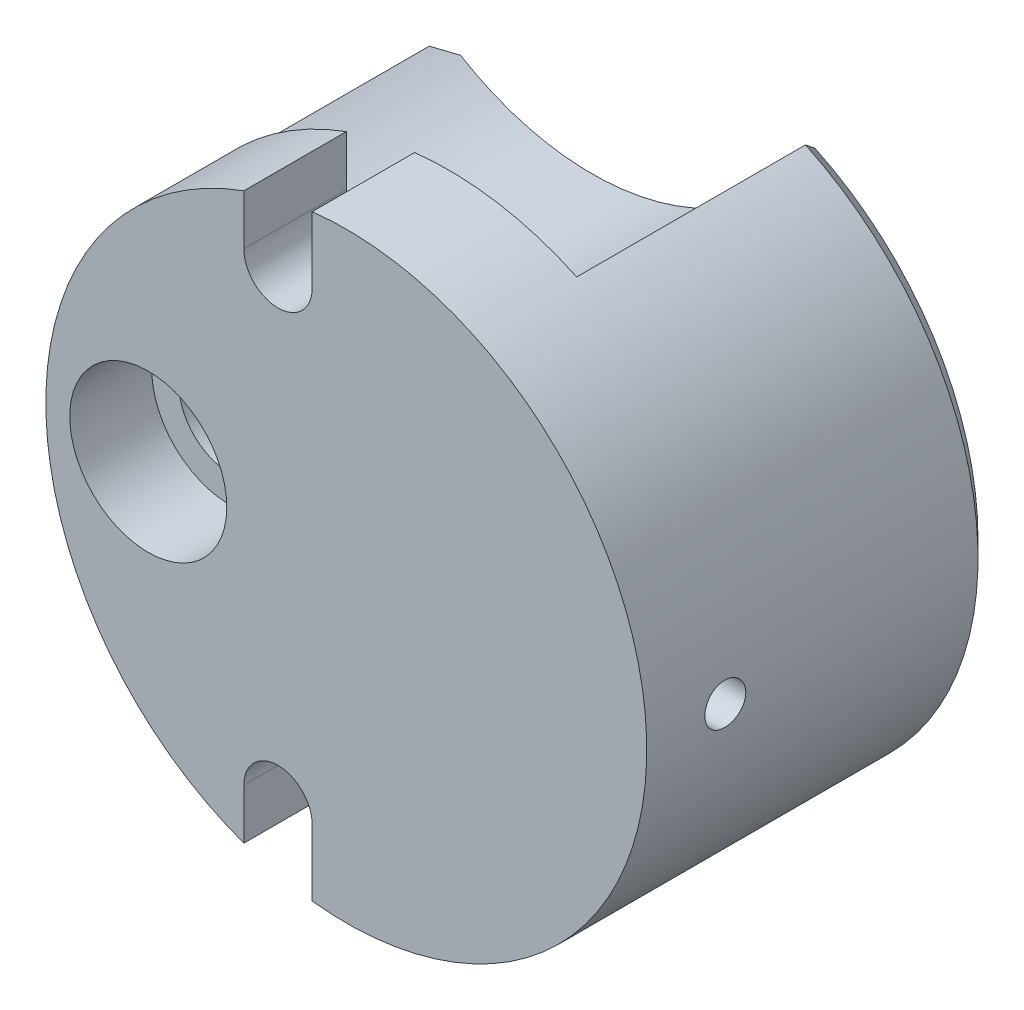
ISO-10303-21;
HEADER;
FILE_DESCRIPTION(('STEP AP214'),'2;1');
FILE_NAME('part.step','',(''),(''),'','','');
FILE_SCHEMA(('AUTOMOTIVE_DESIGN { 1 0 10303 214 1 1 1 1 }'));
ENDSEC;
DATA;
#1=APPLICATION_CONTEXT('core data for automotive mechanical design processes');
#2=APPLICATION_PROTOCOL_DEFINITION('international standard','automotive_design',2000,#1);
#3=PRODUCT_CONTEXT('',#1,'mechanical');
#4=PRODUCT('Part','Part','',(#3));
#5=PRODUCT_RELATED_PRODUCT_CATEGORY('part','',(#4));
#6=PRODUCT_DEFINITION_FORMATION('','',#4);
#7=PRODUCT_DEFINITION_CONTEXT('part definition',#1,'design');
#8=PRODUCT_DEFINITION('design','',#6,#7);
#9=PRODUCT_DEFINITION_SHAPE('','',#8);
#10=(LENGTH_UNIT() NAMED_UNIT(*) SI_UNIT(.MILLI.,.METRE.));
#11=(NAMED_UNIT(*) PLANE_ANGLE_UNIT() SI_UNIT($,.RADIAN.));
#12=(NAMED_UNIT(*) SI_UNIT($,.STERADIAN.) SOLID_ANGLE_UNIT());
#13=UNCERTAINTY_MEASURE_WITH_UNIT(LENGTH_MEASURE(1.E-05),#10,'distance_accuracy_value','');
#14=(GEOMETRIC_REPRESENTATION_CONTEXT(3) GLOBAL_UNCERTAINTY_ASSIGNED_CONTEXT((#13)) GLOBAL_UNIT_ASSIGNED_CONTEXT((#10,
#11,#12)) REPRESENTATION_CONTEXT('',''));
#15=CARTESIAN_POINT('',(0.,0.,0.));
#16=DIRECTION('',(0.,0.,1.));
#17=DIRECTION('',(1.,0.,0.));
#18=AXIS2_PLACEMENT_3D('',#15,#16,#17);
#19=CARTESIAN_POINT('',(0.,0.,-51.));
#20=DIRECTION('',(0.,0.,1.));
#21=DIRECTION('',(1.,0.,0.));
#22=AXIS2_PLACEMENT_3D('',#19,#20,#21);
#23=CYLINDRICAL_SURFACE('',#22,44.);
#24=DIRECTION('',(0.,0.,-1.));
#25=VECTOR('',#24,1.);
#26=CARTESIAN_POINT('',(-15.,-41.3642357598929,0.00100000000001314));
#27=LINE('',#26,#25);
#28=CARTESIAN_POINT('',(-15.,-41.3642357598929,0.));
#29=VERTEX_POINT('',#28);
#30=CARTESIAN_POINT('',(-15.,-41.3642357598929,-15.));
#31=VERTEX_POINT('',#30);
#32=EDGE_CURVE('E144',#29,#31,#27,.T.);
#33=ORIENTED_EDGE('',*,*,#32,.F.);
#34=CARTESIAN_POINT('',(0.,0.,0.));
#35=DIRECTION('',(0.,0.,1.));
#36=DIRECTION('',(1.,0.,0.));
#37=AXIS2_PLACEMENT_3D('',#34,#35,#36);
#38=CIRCLE('',#37,44.);
#39=CARTESIAN_POINT('',(-15.,41.3642357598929,0.));
#40=VERTEX_POINT('',#39);
#41=EDGE_CURVE('E156',#40,#29,#38,.T.);
#42=ORIENTED_EDGE('',*,*,#41,.F.);
#43=DIRECTION('',(0.,0.,-1.));
#44=VECTOR('',#43,1.);
#45=CARTESIAN_POINT('',(-15.,41.3642357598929,0.00100000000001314));
#46=LINE('',#45,#44);
#47=CARTESIAN_POINT('',(-15.,41.3642357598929,-15.));
#48=VERTEX_POINT('',#47);
#49=EDGE_CURVE('E281',#40,#48,#46,.T.);
#50=ORIENTED_EDGE('',*,*,#49,.T.);
#51=CARTESIAN_POINT('',(0.,0.,-15.));
#52=DIRECTION('',(0.,0.,1.));
#53=DIRECTION('',(1.,0.,0.));
#54=AXIS2_PLACEMENT_3D('',#51,#52,#53);
#55=CIRCLE('',#54,44.);
#56=CARTESIAN_POINT('',(-36.3552998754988,24.7849182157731,-15.));
#57=VERTEX_POINT('',#56);
#58=EDGE_CURVE('E261',#48,#57,#55,.T.);
#59=ORIENTED_EDGE('',*,*,#58,.T.);
#60=DIRECTION('',(0.,0.,-1.));
#61=VECTOR('',#60,1.);
#62=CARTESIAN_POINT('',(-36.3552998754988,24.7849182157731,-15.));
#63=LINE('',#62,#61);
#64=CARTESIAN_POINT('',(-36.3552998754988,24.7849182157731,-48.5));
#65=VERTEX_POINT('',#64);
#66=EDGE_CURVE('E248',#57,#65,#63,.T.);
#67=ORIENTED_EDGE('',*,*,#66,.T.);
#68=CARTESIAN_POINT('',(0.,0.,-48.5));
#69=DIRECTION('',(0.,0.,1.));
#70=DIRECTION('',(1.,0.,0.));
#71=AXIS2_PLACEMENT_3D('',#68,#69,#70);
#72=CIRCLE('',#71,44.);
#73=CARTESIAN_POINT('',(-36.3552998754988,-24.7849182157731,-48.5));
#74=VERTEX_POINT('',#73);
#75=EDGE_CURVE('E170',#65,#74,#72,.T.);
#76=ORIENTED_EDGE('',*,*,#75,.T.);
#77=DIRECTION('',(0.,0.,-1.));
#78=VECTOR('',#77,1.);
#79=CARTESIAN_POINT('',(-36.3552998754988,-24.7849182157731,-15.));
#80=LINE('',#79,#78);
#81=CARTESIAN_POINT('',(-36.3552998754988,-24.7849182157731,-15.));
#82=VERTEX_POINT('',#81);
#83=EDGE_CURVE('E268',#82,#74,#80,.T.);
#84=ORIENTED_EDGE('',*,*,#83,.F.);
#85=CARTESIAN_POINT('',(0.,0.,-15.));
#86=DIRECTION('',(0.,0.,1.));
#87=DIRECTION('',(1.,0.,0.));
#88=AXIS2_PLACEMENT_3D('',#85,#86,#87);
#89=CIRCLE('',#88,44.);
#90=EDGE_CURVE('E159',#82,#31,#89,.T.);
#91=ORIENTED_EDGE('',*,*,#90,.T.);
#92=EDGE_LOOP('',(#33,#42,#50,#59,#67,#76,#84,#91));
#93=FACE_BOUND('',#92,.T.);
#94=ADVANCED_FACE('F32',(#93),#23,.T.);
#95=DIRECTION('',(0.,0.,-1.));
#96=VECTOR('',#95,1.);
#97=CARTESIAN_POINT('',(-5.00000000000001,-43.7149859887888,0.00100000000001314));
#98=LINE('',#97,#96);
#99=CARTESIAN_POINT('',(-5.00000000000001,-43.7149859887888,0.));
#100=VERTEX_POINT('',#99);
#101=CARTESIAN_POINT('',(-5.00000000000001,-43.7149859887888,-15.));
#102=VERTEX_POINT('',#101);
#103=EDGE_CURVE('E160',#100,#102,#98,.T.);
#104=ORIENTED_EDGE('',*,*,#103,.T.);
#105=CARTESIAN_POINT('',(18.7383767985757,-39.8104663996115,-15.));
#106=VERTEX_POINT('',#105);
#107=EDGE_CURVE('E273',#102,#106,#89,.T.);
#108=ORIENTED_EDGE('',*,*,#107,.T.);
#109=DIRECTION('',(0.,0.,-1.));
#110=VECTOR('',#109,1.);
#111=CARTESIAN_POINT('',(18.7383767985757,-39.8104663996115,-15.));
#112=LINE('',#111,#110);
#113=CARTESIAN_POINT('',(18.7383767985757,-39.8104663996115,-48.5));
#114=VERTEX_POINT('',#113);
#115=EDGE_CURVE('E265',#106,#114,#112,.T.);
#116=ORIENTED_EDGE('',*,*,#115,.T.);
#117=CARTESIAN_POINT('',(18.7383767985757,39.8104663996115,-48.5));
#118=VERTEX_POINT('',#117);
#119=EDGE_CURVE('E167',#114,#118,#72,.T.);
#120=ORIENTED_EDGE('',*,*,#119,.T.);
#121=DIRECTION('',(0.,0.,-1.));
#122=VECTOR('',#121,1.);
#123=CARTESIAN_POINT('',(18.7383767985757,39.8104663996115,-15.));
#124=LINE('',#123,#122);
#125=CARTESIAN_POINT('',(18.7383767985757,39.8104663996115,-15.));
#126=VERTEX_POINT('',#125);
#127=EDGE_CURVE('E250',#126,#118,#124,.T.);
#128=ORIENTED_EDGE('',*,*,#127,.F.);
#129=CARTESIAN_POINT('',(-5.00000000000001,43.7149859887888,-15.));
#130=VERTEX_POINT('',#129);
#131=EDGE_CURVE('E258',#126,#130,#55,.T.);
#132=ORIENTED_EDGE('',*,*,#131,.T.);
#133=DIRECTION('',(0.,0.,-1.));
#134=VECTOR('',#133,1.);
#135=CARTESIAN_POINT('',(-5.00000000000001,43.7149859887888,0.00100000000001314));
#136=LINE('',#135,#134);
#137=CARTESIAN_POINT('',(-5.00000000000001,43.7149859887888,0.));
#138=VERTEX_POINT('',#137);
#139=EDGE_CURVE('E284',#138,#130,#136,.T.);
#140=ORIENTED_EDGE('',*,*,#139,.F.);
#141=EDGE_CURVE('E168',#100,#138,#38,.T.);
#142=ORIENTED_EDGE('',*,*,#141,.F.);
#143=EDGE_LOOP('',(#104,#108,#116,#120,#128,#132,#140,#142));
#144=FACE_BOUND('',#143,.T.);
#145=CARTESIAN_POINT('',(44.,0.,-14.5));
#146=CARTESIAN_POINT('',(43.9999986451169,-0.168301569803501,-14.4999926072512));
#147=CARTESIAN_POINT('',(43.9990240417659,-0.336720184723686,-14.4857896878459));
#148=CARTESIAN_POINT('',(43.9952298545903,-0.668904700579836,-14.4293365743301));
#149=CARTESIAN_POINT('',(43.9924081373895,-0.832664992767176,-14.3870539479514));
#150=CARTESIAN_POINT('',(43.9852388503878,-1.15067322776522,-14.2756635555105));
#151=CARTESIAN_POINT('',(43.9808920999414,-1.30492622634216,-14.2065701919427));
#152=CARTESIAN_POINT('',(43.971161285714,-1.59960561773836,-14.0435435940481));
#153=CARTESIAN_POINT('',(43.9657774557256,-1.74003511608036,-13.9496159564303));
#154=CARTESIAN_POINT('',(43.9545668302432,-2.00336718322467,-13.7394073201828));
#155=CARTESIAN_POINT('',(43.9487393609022,-2.12624224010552,-13.6230918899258));
#156=CARTESIAN_POINT('',(43.9373039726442,-2.35074192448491,-13.3714810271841));
#157=CARTESIAN_POINT('',(43.9316960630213,-2.45236565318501,-13.236184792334));
#158=CARTESIAN_POINT('',(43.9213269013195,-2.63156551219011,-12.9502935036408));
#159=CARTESIAN_POINT('',(43.9165664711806,-2.7091183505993,-12.799683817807));
#160=CARTESIAN_POINT('',(43.9084379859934,-2.83782604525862,-12.4875432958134));
#161=CARTESIAN_POINT('',(43.9050699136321,-2.88898122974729,-12.3260125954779));
#162=CARTESIAN_POINT('',(43.9001124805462,-2.96336399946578,-11.9968839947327));
#163=CARTESIAN_POINT('',(43.8985203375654,-2.98663527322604,-11.8292960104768));
#164=CARTESIAN_POINT('',(43.8972859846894,-3.00472452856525,-11.4925855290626));
#165=CARTESIAN_POINT('',(43.8976437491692,-2.99954288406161,-11.3234630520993));
#166=CARTESIAN_POINT('',(43.9002662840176,-2.96090960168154,-10.9887824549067));
#167=CARTESIAN_POINT('',(43.902527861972,-2.92750528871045,-10.823218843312));
#168=CARTESIAN_POINT('',(43.9086981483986,-2.83344832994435,-10.5000541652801));
#169=CARTESIAN_POINT('',(43.912606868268,-2.77279549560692,-10.3424531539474));
#170=CARTESIAN_POINT('',(43.921634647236,-2.62590965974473,-10.0395356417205));
#171=CARTESIAN_POINT('',(43.9267547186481,-2.53965524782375,-9.89422955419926));
#172=CARTESIAN_POINT('',(43.9376272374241,-2.34403019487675,-9.62014044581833));
#173=CARTESIAN_POINT('',(43.9433796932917,-2.23465924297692,-9.49135764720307));
#174=CARTESIAN_POINT('',(43.9548829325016,-1.99563948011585,-9.25369548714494));
#175=CARTESIAN_POINT('',(43.9606336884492,-1.86594972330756,-9.14485729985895));
#176=CARTESIAN_POINT('',(43.9714742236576,-1.59011713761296,-8.95049165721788));
#177=CARTESIAN_POINT('',(43.9765640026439,-1.44397430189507,-8.86496421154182));
#178=CARTESIAN_POINT('',(43.9855095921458,-1.13935860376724,-8.71965112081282));
#179=CARTESIAN_POINT('',(43.9893653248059,-0.980884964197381,-8.65986709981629));
#180=CARTESIAN_POINT('',(43.995407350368,-0.656117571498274,-8.56776573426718));
#181=CARTESIAN_POINT('',(43.9975936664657,-0.489823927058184,-8.53544800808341));
#182=CARTESIAN_POINT('',(44.0000475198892,-0.154494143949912,-8.49924778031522));
#183=CARTESIAN_POINT('',(44.0003188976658,0.0145358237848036,-8.49530836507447));
#184=CARTESIAN_POINT('',(43.9989225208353,0.350854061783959,-8.51582778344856));
#185=CARTESIAN_POINT('',(43.9972547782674,0.518142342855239,-8.54028644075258));
#186=CARTESIAN_POINT('',(43.99217033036,0.846067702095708,-8.61686057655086));
#187=CARTESIAN_POINT('',(43.9887552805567,1.00671092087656,-8.66894987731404));
#188=CARTESIAN_POINT('',(43.9805602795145,1.31697578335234,-8.79928005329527));
#189=CARTESIAN_POINT('',(43.9757803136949,1.46659730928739,-8.87752120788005));
#190=CARTESIAN_POINT('',(43.9653826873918,1.75083181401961,-9.05807854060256));
#191=CARTESIAN_POINT('',(43.9597637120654,1.8854206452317,-9.16043265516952));
#192=CARTESIAN_POINT('',(43.9483245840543,2.13552602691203,-9.3862553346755));
#193=CARTESIAN_POINT('',(43.9425044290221,2.25104235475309,-9.50972414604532));
#194=CARTESIAN_POINT('',(43.9313077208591,2.45991703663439,-9.77451729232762));
#195=CARTESIAN_POINT('',(43.9259319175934,2.55323841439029,-9.91587083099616));
#196=CARTESIAN_POINT('',(43.9162421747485,2.71482107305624,-10.2122745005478));
#197=CARTESIAN_POINT('',(43.9119282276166,2.78308253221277,-10.3673245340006));
#198=CARTESIAN_POINT('',(43.9048541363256,2.89254388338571,-10.6865858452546));
#199=CARTESIAN_POINT('',(43.9020926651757,2.9337668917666,-10.8507891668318));
#200=CARTESIAN_POINT('',(43.8984312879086,2.98805661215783,-11.1838060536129));
#201=CARTESIAN_POINT('',(43.8975313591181,3.00112366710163,-11.3526195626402));
#202=CARTESIAN_POINT('',(43.897695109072,2.99872711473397,-11.6896972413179));
#203=CARTESIAN_POINT('',(43.8987547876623,2.98332162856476,-11.8579618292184));
#204=CARTESIAN_POINT('',(43.9027098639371,2.92453797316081,-12.1895088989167));
#205=CARTESIAN_POINT('',(43.9056052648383,2.88115975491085,-12.3527913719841));
#206=CARTESIAN_POINT('',(43.9129045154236,2.76767552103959,-12.6697466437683));
#207=CARTESIAN_POINT('',(43.9173083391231,2.69756996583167,-12.8234196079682));
#208=CARTESIAN_POINT('',(43.9271281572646,2.53262856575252,-13.1168224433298));
#209=CARTESIAN_POINT('',(43.9325441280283,2.43779329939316,-13.2565526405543));
#210=CARTESIAN_POINT('',(43.9437909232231,2.22586812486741,-13.5183993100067));
#211=CARTESIAN_POINT('',(43.9496225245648,2.10873581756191,-13.6404814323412));
#212=CARTESIAN_POINT('',(43.9610366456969,1.85560577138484,-13.8632942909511));
#213=CARTESIAN_POINT('',(43.9666191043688,1.71960343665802,-13.964019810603));
#214=CARTESIAN_POINT('',(43.9769127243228,1.43241329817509,-14.1413489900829));
#215=CARTESIAN_POINT('',(43.9816226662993,1.2812046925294,-14.2179189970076));
#216=CARTESIAN_POINT('',(43.9896248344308,0.968153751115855,-14.3444893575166));
#217=CARTESIAN_POINT('',(43.992918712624,0.806324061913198,-14.3945206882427));
#218=CARTESIAN_POINT('',(43.9968587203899,0.536260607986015,-14.4536536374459));
#219=CARTESIAN_POINT('',(43.9980314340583,0.429770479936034,-14.4710108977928));
#220=CARTESIAN_POINT('',(43.9996025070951,0.215536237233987,-14.4941864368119));
#221=CARTESIAN_POINT('',(44.0000008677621,0.107792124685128,-14.5000047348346));
#222=CARTESIAN_POINT('',(44.,0.,-14.5));
#223=B_SPLINE_CURVE_WITH_KNOTS('',3,(#145,#146,#147,#148,#149,#150,#151,#152,#153,#154,#155,
#156,#157,#158,#159,#160,#161,#162,#163,#164,#165,#166,#167,#168,#169,#170,#171,#172,#173,#174,
#175,#176,#177,#178,#179,#180,#181,#182,#183,#184,#185,#186,#187,#188,#189,#190,#191,#192,#193,
#194,#195,#196,#197,#198,#199,#200,#201,#202,#203,#204,#205,#206,#207,#208,#209,#210,#211,#212,
#213,#214,#215,#216,#217,#218,#219,#220,#221,#222),.UNSPECIFIED.,.T.,.F.,(4,2,2,2,2,2,2,2,2,2,2,
2,2,2,2,2,2,2,2,2,2,2,2,2,2,2,2,2,2,2,2,2,2,2,2,2,2,2,4),(0.,0.504511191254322,1.00960611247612,
1.51443007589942,2.01914036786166,2.52463317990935,3.03014736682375,3.53614919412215,
4.04214472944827,4.5473464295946,5.05254149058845,5.55689109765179,6.06124419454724,
6.56602027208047,7.07080313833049,7.57661663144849,8.08243033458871,8.58827594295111,
9.0941145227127,9.59893834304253,10.1037590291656,10.6081022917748,11.1124509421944,
11.6175984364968,12.1227518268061,12.6287409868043,13.1347265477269,13.640278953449,
14.1458252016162,14.6503406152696,15.1548569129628,15.6593645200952,16.1638603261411,
16.6693252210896,17.1749134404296,17.6812029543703,18.186900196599,18.5100250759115,
18.8331494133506),.UNSPECIFIED.);
#224=CARTESIAN_POINT('',(44.,0.,-14.5));
#225=VERTEX_POINT('',#224);
#226=EDGE_CURVE('E216',#225,#225,#223,.T.);
#227=ORIENTED_EDGE('',*,*,#226,.T.);
#228=EDGE_LOOP('',(#227));
#229=FACE_BOUND('',#228,.T.);
#230=ADVANCED_FACE('F34',(#144,#229),#23,.T.);
#231=CARTESIAN_POINT('',(0.,0.,-51.));
#232=DIRECTION('',(0.,0.,1.));
#233=DIRECTION('',(1.,0.,0.));
#234=AXIS2_PLACEMENT_3D('',#231,#232,#233);
#235=PLANE('',#234);
#236=CARTESIAN_POINT('',(-29.,0.,-51.));
#237=DIRECTION('',(0.,0.,1.));
#238=DIRECTION('',(1.,0.,0.));
#239=AXIS2_PLACEMENT_3D('',#236,#237,#238);
#240=CIRCLE('',#239,10.);
#241=CARTESIAN_POINT('',(-19.,0.,-51.));
#242=VERTEX_POINT('',#241);
#243=EDGE_CURVE('E627',#242,#242,#240,.T.);
#244=ORIENTED_EDGE('',*,*,#243,.T.);
#245=EDGE_LOOP('',(#244));
#246=FACE_BOUND('',#245,.T.);
#247=CARTESIAN_POINT('',(16.5,0.,-51.));
#248=DIRECTION('',(0.,0.,-1.));
#249=DIRECTION('',(-1.,0.,0.));
#250=AXIS2_PLACEMENT_3D('',#247,#248,#249);
#251=CIRCLE('',#250,21.5);
#252=CARTESIAN_POINT('',(-5.,0.,-51.));
#253=VERTEX_POINT('',#252);
#254=EDGE_CURVE('E624',#253,#253,#251,.T.);
#255=ORIENTED_EDGE('',*,*,#254,.F.);
#256=EDGE_LOOP('',(#255));
#257=FACE_BOUND('',#256,.T.);
#258=CARTESIAN_POINT('',(-15.,-55.,-51.));
#259=DIRECTION('',(0.,0.,1.));
#260=DIRECTION('',(1.,0.,0.));
#261=AXIS2_PLACEMENT_3D('',#258,#259,#260);
#262=CIRCLE('',#261,37.);
#263=CARTESIAN_POINT('',(17.6354501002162,-37.566486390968,-51.));
#264=VERTEX_POINT('',#263);
#265=CARTESIAN_POINT('',(-34.2658347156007,-23.4115905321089,-51.));
#266=VERTEX_POINT('',#265);
#267=EDGE_CURVE('E274',#264,#266,#262,.T.);
#268=ORIENTED_EDGE('',*,*,#267,.T.);
#269=CARTESIAN_POINT('',(0.,0.,-51.));
#270=DIRECTION('',(0.,0.,1.));
#271=DIRECTION('',(1.,0.,0.));
#272=AXIS2_PLACEMENT_3D('',#269,#270,#271);
#273=CIRCLE('',#272,41.5);
#274=CARTESIAN_POINT('',(-34.2658347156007,23.4115905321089,-51.));
#275=VERTEX_POINT('',#274);
#276=EDGE_CURVE('E177',#266,#275,#273,.F.);
#277=ORIENTED_EDGE('',*,*,#276,.T.);
#278=CARTESIAN_POINT('',(-15.,55.,-51.));
#279=DIRECTION('',(0.,0.,1.));
#280=DIRECTION('',(1.,0.,0.));
#281=AXIS2_PLACEMENT_3D('',#278,#279,#280);
#282=CIRCLE('',#281,37.);
#283=CARTESIAN_POINT('',(17.6354501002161,37.566486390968,-51.));
#284=VERTEX_POINT('',#283);
#285=EDGE_CURVE('E262',#275,#284,#282,.T.);
#286=ORIENTED_EDGE('',*,*,#285,.T.);
#287=EDGE_CURVE('E178',#284,#264,#273,.F.);
#288=ORIENTED_EDGE('',*,*,#287,.T.);
#289=EDGE_LOOP('',(#268,#277,#286,#288));
#290=FACE_BOUND('',#289,.T.);
#291=ADVANCED_FACE('F237',(#246,#257,#290),#235,.F.);
#292=CARTESIAN_POINT('',(0.,0.,-48.5));
#293=DIRECTION('',(0.,0.,1.));
#294=DIRECTION('',(1.,0.,0.));
#295=AXIS2_PLACEMENT_3D('',#292,#293,#294);
#296=CONICAL_SURFACE('',#295,44.,0.78539816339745);
#297=ORIENTED_EDGE('',*,*,#119,.F.);
#298=CARTESIAN_POINT('',(18.7384589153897,-39.8106487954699,-48.4998));
#299=CARTESIAN_POINT('',(18.5673070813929,-39.4304874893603,-48.9166560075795));
#300=CARTESIAN_POINT('',(18.3898058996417,-39.0533785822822,-49.3334506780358));
#301=CARTESIAN_POINT('',(18.0221048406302,-38.3052655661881,-50.1669173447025));
#302=CARTESIAN_POINT('',(17.83190496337,-37.9342614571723,-50.5835893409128));
#303=CARTESIAN_POINT('',(17.6353557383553,-37.5663097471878,-51.0002));
#304=B_SPLINE_CURVE_WITH_KNOTS('',3,(#298,#299,#300,#301,#302,#303),.UNSPECIFIED.,.F.,.F.,(4,2,
4),(0.,1.76831002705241,3.53662005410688),.UNSPECIFIED.);
#305=EDGE_CURVE('E12',#114,#264,#304,.T.);
#306=ORIENTED_EDGE('',*,*,#305,.T.);
#307=ORIENTED_EDGE('',*,*,#287,.F.);
#308=CARTESIAN_POINT('',(17.6353557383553,37.5663097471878,-51.0002));
#309=CARTESIAN_POINT('',(17.83190496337,37.9342614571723,-50.5835893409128));
#310=CARTESIAN_POINT('',(18.0221048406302,38.3052655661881,-50.1669173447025));
#311=CARTESIAN_POINT('',(18.3898058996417,39.0533785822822,-49.3334506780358));
#312=CARTESIAN_POINT('',(18.5673070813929,39.4304874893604,-48.9166560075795));
#313=CARTESIAN_POINT('',(18.7384589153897,39.8106487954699,-48.4998));
#314=B_SPLINE_CURVE_WITH_KNOTS('',3,(#308,#309,#310,#311,#312,#313),.UNSPECIFIED.,.F.,.F.,(4,2,
4),(0.,1.76831002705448,3.53662005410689),.UNSPECIFIED.);
#315=EDGE_CURVE('E181',#284,#118,#314,.T.);
#316=ORIENTED_EDGE('',*,*,#315,.T.);
#317=EDGE_LOOP('',(#297,#306,#307,#316));
#318=FACE_BOUND('',#317,.T.);
#319=ADVANCED_FACE('F192',(#318),#296,.T.);
#320=ORIENTED_EDGE('',*,*,#276,.F.);
#321=CARTESIAN_POINT('',(-34.2656637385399,-23.4114862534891,-51.0002));
#322=CARTESIAN_POINT('',(-34.621804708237,-23.6287042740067,-50.5835893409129));
#323=CARTESIAN_POINT('',(-34.9740251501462,-23.8517755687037,-50.1669173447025));
#324=CARTESIAN_POINT('',(-35.6706249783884,-24.3096247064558,-49.3334506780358));
#325=CARTESIAN_POINT('',(-36.0150043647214,-24.544402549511,-48.9166560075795));
#326=CARTESIAN_POINT('',(-36.3554632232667,-24.7850336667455,-48.4998));
#327=B_SPLINE_CURVE_WITH_KNOTS('',3,(#321,#322,#323,#324,#325,#326),.UNSPECIFIED.,.F.,.F.,(4,2,
4),(0.,1.7683100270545,3.53662005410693),.UNSPECIFIED.);
#328=EDGE_CURVE('E45',#266,#74,#327,.T.);
#329=ORIENTED_EDGE('',*,*,#328,.T.);
#330=ORIENTED_EDGE('',*,*,#75,.F.);
#331=CARTESIAN_POINT('',(-36.3554632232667,24.7850336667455,-48.4998));
#332=CARTESIAN_POINT('',(-36.0150043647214,24.544402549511,-48.9166560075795));
#333=CARTESIAN_POINT('',(-35.6706249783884,24.3096247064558,-49.3334506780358));
#334=CARTESIAN_POINT('',(-34.9740251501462,23.8517755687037,-50.1669173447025));
#335=CARTESIAN_POINT('',(-34.621804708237,23.6287042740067,-50.5835893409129));
#336=CARTESIAN_POINT('',(-34.2656637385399,23.4114862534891,-51.0002));
#337=B_SPLINE_CURVE_WITH_KNOTS('',3,(#331,#332,#333,#334,#335,#336),.UNSPECIFIED.,.F.,.F.,(4,2,
4),(0.,1.76831002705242,3.53662005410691),.UNSPECIFIED.);
#338=EDGE_CURVE('E188',#65,#275,#337,.T.);
#339=ORIENTED_EDGE('',*,*,#338,.T.);
#340=EDGE_LOOP('',(#320,#329,#330,#339));
#341=FACE_BOUND('',#340,.T.);
#342=ADVANCED_FACE('F328',(#341),#296,.T.);
#343=CARTESIAN_POINT('',(0.,0.,0.));
#344=DIRECTION('',(0.,0.,1.));
#345=DIRECTION('',(1.,0.,0.));
#346=AXIS2_PLACEMENT_3D('',#343,#344,#345);
#347=PLANE('',#346);
#348=DIRECTION('',(0.,1.,0.));
#349=VECTOR('',#348,1.);
#350=CARTESIAN_POINT('',(-15.,-34.,0.));
#351=LINE('',#350,#349);
#352=CARTESIAN_POINT('',(-15.,-34.,0.));
#353=VERTEX_POINT('',#352);
#354=EDGE_CURVE('E140',#29,#353,#351,.T.);
#355=ORIENTED_EDGE('',*,*,#354,.T.);
#356=CARTESIAN_POINT('',(-10.,-34.,0.));
#357=DIRECTION('',(0.,0.,1.));
#358=DIRECTION('',(1.,0.,0.));
#359=AXIS2_PLACEMENT_3D('',#356,#357,#358);
#360=CIRCLE('',#359,5.);
#361=CARTESIAN_POINT('',(-5.,-34.,0.));
#362=VERTEX_POINT('',#361);
#363=EDGE_CURVE('E150',#353,#362,#360,.F.);
#364=ORIENTED_EDGE('',*,*,#363,.T.);
#365=DIRECTION('',(0.,-1.,0.));
#366=VECTOR('',#365,1.);
#367=CARTESIAN_POINT('',(-5.,-34.,0.));
#368=LINE('',#367,#366);
#369=EDGE_CURVE('E297',#362,#100,#368,.T.);
#370=ORIENTED_EDGE('',*,*,#369,.T.);
#371=ORIENTED_EDGE('',*,*,#141,.T.);
#372=DIRECTION('',(0.,-1.,0.));
#373=VECTOR('',#372,1.);
#374=CARTESIAN_POINT('',(-5.00000000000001,43.7149859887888,0.));
#375=LINE('',#374,#373);
#376=CARTESIAN_POINT('',(-5.00000000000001,34.,0.));
#377=VERTEX_POINT('',#376);
#378=EDGE_CURVE('E292',#138,#377,#375,.T.);
#379=ORIENTED_EDGE('',*,*,#378,.T.);
#380=CARTESIAN_POINT('',(-10.,34.,0.));
#381=DIRECTION('',(0.,0.,1.));
#382=DIRECTION('',(1.,0.,0.));
#383=AXIS2_PLACEMENT_3D('',#380,#381,#382);
#384=CIRCLE('',#383,5.);
#385=CARTESIAN_POINT('',(-15.,34.,0.));
#386=VERTEX_POINT('',#385);
#387=EDGE_CURVE('E295',#377,#386,#384,.F.);
#388=ORIENTED_EDGE('',*,*,#387,.T.);
#389=DIRECTION('',(0.,1.,0.));
#390=VECTOR('',#389,1.);
#391=CARTESIAN_POINT('',(-15.,41.3642357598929,0.));
#392=LINE('',#391,#390);
#393=EDGE_CURVE('E166',#386,#40,#392,.T.);
#394=ORIENTED_EDGE('',*,*,#393,.T.);
#395=ORIENTED_EDGE('',*,*,#41,.T.);
#396=EDGE_LOOP('',(#355,#364,#370,#371,#379,#388,#394,#395));
#397=FACE_BOUND('',#396,.T.);
#398=CARTESIAN_POINT('',(-29.,0.,0.));
#399=DIRECTION('',(0.,0.,1.));
#400=DIRECTION('',(1.,0.,0.));
#401=AXIS2_PLACEMENT_3D('',#398,#399,#400);
#402=CIRCLE('',#401,11.5);
#403=CARTESIAN_POINT('',(-17.5,0.,0.));
#404=VERTEX_POINT('',#403);
#405=EDGE_CURVE('E215',#404,#404,#402,.T.);
#406=ORIENTED_EDGE('',*,*,#405,.F.);
#407=EDGE_LOOP('',(#406));
#408=FACE_BOUND('',#407,.T.);
#409=ADVANCED_FACE('F163',(#397,#408),#347,.T.);
#410=CARTESIAN_POINT('',(1.5,0.,-6.99999999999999));
#411=DIRECTION('',(0.,0.,1.));
#412=DIRECTION('',(1.,0.,0.));
#413=AXIS2_PLACEMENT_3D('',#410,#411,#412);
#414=PLANE('',#413);
#415=CARTESIAN_POINT('',(16.5,0.,-6.99999999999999));
#416=DIRECTION('',(0.,0.,-1.));
#417=DIRECTION('',(-1.,0.,0.));
#418=AXIS2_PLACEMENT_3D('',#415,#416,#417);
#419=CIRCLE('',#418,15.);
#420=CARTESIAN_POINT('',(1.5,0.,-6.99999999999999));
#421=VERTEX_POINT('',#420);
#422=EDGE_CURVE('E172',#421,#421,#419,.T.);
#423=ORIENTED_EDGE('',*,*,#422,.T.);
#424=EDGE_LOOP('',(#423));
#425=FACE_BOUND('',#424,.T.);
#426=ADVANCED_FACE('F560',(#425),#414,.F.);
#427=CARTESIAN_POINT('',(16.5,0.,-5.00000000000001));
#428=DIRECTION('',(0.,0.,-1.));
#429=DIRECTION('',(-1.,0.,0.));
#430=AXIS2_PLACEMENT_3D('',#427,#428,#429);
#431=CYLINDRICAL_SURFACE('',#430,15.);
#432=CARTESIAN_POINT('',(31.5,0.,-14.5));
#433=CARTESIAN_POINT('',(31.4999969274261,-0.1667307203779,-14.499993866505));
#434=CARTESIAN_POINT('',(31.4971915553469,-0.333538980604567,-14.4860534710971));
#435=CARTESIAN_POINT('',(31.4862709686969,-0.662440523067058,-14.4307044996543));
#436=CARTESIAN_POINT('',(31.4781515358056,-0.824529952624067,-14.3892741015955));
#437=CARTESIAN_POINT('',(31.4575094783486,-1.13919091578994,-14.2802761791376));
#438=CARTESIAN_POINT('',(31.4449910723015,-1.2917714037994,-14.2127336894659));
#439=CARTESIAN_POINT('',(31.4169119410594,-1.58342396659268,-14.0535032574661));
#440=CARTESIAN_POINT('',(31.4013513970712,-1.72249684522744,-13.9618167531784));
#441=CARTESIAN_POINT('',(31.3686649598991,-1.9850804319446,-13.7555845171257));
#442=CARTESIAN_POINT('',(31.3515223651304,-2.10838185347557,-13.6407749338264));
#443=CARTESIAN_POINT('',(31.3177254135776,-2.33411026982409,-13.3921227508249));
#444=CARTESIAN_POINT('',(31.3010710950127,-2.43653563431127,-13.2582786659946));
#445=CARTESIAN_POINT('',(31.2699732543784,-2.61849526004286,-12.9738514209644));
#446=CARTESIAN_POINT('',(31.2555512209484,-2.6978128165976,-12.8231270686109));
#447=CARTESIAN_POINT('',(31.2307880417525,-2.82991699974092,-12.5101545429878));
#448=CARTESIAN_POINT('',(31.2204464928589,-2.88270624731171,-12.347907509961));
#449=CARTESIAN_POINT('',(31.2051841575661,-2.95957589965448,-12.0187469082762));
#450=CARTESIAN_POINT('',(31.2001941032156,-2.98402349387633,-11.8519223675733));
#451=CARTESIAN_POINT('',(31.1959912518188,-3.00465638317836,-11.516470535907));
#452=CARTESIAN_POINT('',(31.1967778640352,-3.0008445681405,-11.3478434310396));
#453=CARTESIAN_POINT('',(31.2039765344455,-2.96536371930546,-11.016259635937));
#454=CARTESIAN_POINT('',(31.2103035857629,-2.93411562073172,-10.8532557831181));
#455=CARTESIAN_POINT('',(31.2277363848,-2.84531365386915,-10.534851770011));
#456=CARTESIAN_POINT('',(31.2388423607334,-2.78775852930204,-10.379451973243));
#457=CARTESIAN_POINT('',(31.2646685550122,-2.64757435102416,-10.0794542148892));
#458=CARTESIAN_POINT('',(31.2794126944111,-2.56477845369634,-9.93493636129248));
#459=CARTESIAN_POINT('',(31.3108385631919,-2.37658072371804,-9.66168745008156));
#460=CARTESIAN_POINT('',(31.327520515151,-2.27117629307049,-9.53295820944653));
#461=CARTESIAN_POINT('',(31.3613106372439,-2.03849980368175,-9.29251179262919));
#462=CARTESIAN_POINT('',(31.3784210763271,-1.91086848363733,-9.18114229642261));
#463=CARTESIAN_POINT('',(31.4108654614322,-1.63855507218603,-8.98133846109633));
#464=CARTESIAN_POINT('',(31.4261993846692,-1.49387276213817,-8.89290441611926));
#465=CARTESIAN_POINT('',(31.4534007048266,-1.19117816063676,-8.74141747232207));
#466=CARTESIAN_POINT('',(31.4652626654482,-1.0331454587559,-8.67840431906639));
#467=CARTESIAN_POINT('',(31.4841422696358,-0.708446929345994,-8.5799185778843));
#468=CARTESIAN_POINT('',(31.4911605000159,-0.541782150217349,-8.54444265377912));
#469=CARTESIAN_POINT('',(31.499480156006,-0.207538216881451,-8.50253063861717));
#470=CARTESIAN_POINT('',(31.5008752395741,-0.0400209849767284,-8.49561874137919));
#471=CARTESIAN_POINT('',(31.4980515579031,0.293774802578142,-8.50974957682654));
#472=CARTESIAN_POINT('',(31.4938331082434,0.46005342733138,-8.53079073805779));
#473=CARTESIAN_POINT('',(31.4803149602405,0.785116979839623,-8.59983512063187));
#474=CARTESIAN_POINT('',(31.4710612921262,0.94395584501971,-8.64759420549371));
#475=CARTESIAN_POINT('',(31.448506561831,1.251370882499,-8.76845194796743));
#476=CARTESIAN_POINT('',(31.4352051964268,1.39994628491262,-8.84155250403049));
#477=CARTESIAN_POINT('',(31.4057973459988,1.68462352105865,-9.01204747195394));
#478=CARTESIAN_POINT('',(31.3896585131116,1.82055038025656,-9.10972834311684));
#479=CARTESIAN_POINT('',(31.3564420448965,2.07425405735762,-9.32622757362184));
#480=CARTESIAN_POINT('',(31.3393643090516,2.19202892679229,-9.4450481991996));
#481=CARTESIAN_POINT('',(31.305879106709,2.40792177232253,-9.70262005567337));
#482=CARTESIAN_POINT('',(31.2894858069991,2.50571310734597,-9.84164723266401));
#483=CARTESIAN_POINT('',(31.2595257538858,2.67655626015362,-10.13443408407));
#484=CARTESIAN_POINT('',(31.2459588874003,2.74960906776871,-10.2881931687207));
#485=CARTESIAN_POINT('',(31.2233022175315,2.86845552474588,-10.6053047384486));
#486=CARTESIAN_POINT('',(31.2141892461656,2.91439049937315,-10.768602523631));
#487=CARTESIAN_POINT('',(31.2014231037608,2.97812595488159,-11.1008003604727));
#488=CARTESIAN_POINT('',(31.1977692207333,2.99593010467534,-11.269699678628));
#489=CARTESIAN_POINT('',(31.1963744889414,3.00276273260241,-11.605026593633));
#490=CARTESIAN_POINT('',(31.198527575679,2.99230736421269,-11.771443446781));
#491=CARTESIAN_POINT('',(31.2082672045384,2.94405691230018,-12.1000949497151));
#492=CARTESIAN_POINT('',(31.2158537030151,2.90626204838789,-12.2623296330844));
#493=CARTESIAN_POINT('',(31.2355579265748,2.80463570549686,-12.5776831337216));
#494=CARTESIAN_POINT('',(31.2476646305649,2.74086752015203,-12.7308230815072));
#495=CARTESIAN_POINT('',(31.2750514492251,2.58916393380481,-13.0243111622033));
#496=CARTESIAN_POINT('',(31.2903318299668,2.50122650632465,-13.1646582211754));
#497=CARTESIAN_POINT('',(31.3226688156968,2.30191774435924,-13.4311467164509));
#498=CARTESIAN_POINT('',(31.339751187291,2.19017366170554,-13.5570062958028));
#499=CARTESIAN_POINT('',(31.3735824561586,1.94719310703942,-13.7883586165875));
#500=CARTESIAN_POINT('',(31.3903312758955,1.81595216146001,-13.8938466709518));
#501=CARTESIAN_POINT('',(31.4218149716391,1.53605288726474,-14.0825039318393));
#502=CARTESIAN_POINT('',(31.4365269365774,1.3872266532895,-14.1654280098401));
#503=CARTESIAN_POINT('',(31.46205375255,1.0774990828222,-14.3049583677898));
#504=CARTESIAN_POINT('',(31.4728721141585,0.916608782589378,-14.3615883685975));
#505=CARTESIAN_POINT('',(31.4872911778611,0.629464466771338,-14.4359558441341));
#506=CARTESIAN_POINT('',(31.4920290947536,0.504844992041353,-14.4599295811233));
#507=CARTESIAN_POINT('',(31.4983846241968,0.2534985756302,-14.4919537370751));
#508=CARTESIAN_POINT('',(31.5000023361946,0.126771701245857,-14.5000046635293));
#509=CARTESIAN_POINT('',(31.5,0.,-14.5));
#510=B_SPLINE_CURVE_WITH_KNOTS('',3,(#432,#433,#434,#435,#436,#437,#438,#439,#440,#441,#442,
#443,#444,#445,#446,#447,#448,#449,#450,#451,#452,#453,#454,#455,#456,#457,#458,#459,#460,#461,
#462,#463,#464,#465,#466,#467,#468,#469,#470,#471,#472,#473,#474,#475,#476,#477,#478,#479,#480,
#481,#482,#483,#484,#485,#486,#487,#488,#489,#490,#491,#492,#493,#494,#495,#496,#497,#498,#499,
#500,#501,#502,#503,#504,#505,#506,#507,#508,#509),.UNSPECIFIED.,.T.,.F.,(4,2,2,2,2,2,2,2,2,2,2,
2,2,2,2,2,2,2,2,2,2,2,2,2,2,2,2,2,2,2,2,2,2,2,2,2,2,2,4),(0.,0.499728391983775,
0.999853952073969,1.49950120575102,1.99911870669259,2.50479801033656,3.0105167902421,
3.52083585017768,4.03110448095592,4.53468555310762,5.03821512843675,5.53415181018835,
6.03011217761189,6.52942470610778,7.02879464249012,7.53714757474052,8.04550702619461,
8.55465824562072,9.06374777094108,9.56432207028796,10.064868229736,10.5609136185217,
11.0569961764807,11.5591519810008,12.0613616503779,12.5712188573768,13.081055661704,
13.5882114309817,14.0953010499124,14.593191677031,15.0910783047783,15.5877588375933,
16.084481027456,16.5896422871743,17.0949196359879,17.6054849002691,18.1155886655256,
18.4955632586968,18.8755257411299),.UNSPECIFIED.);
#511=CARTESIAN_POINT('',(31.5,0.,-14.5));
#512=VERTEX_POINT('',#511);
#513=EDGE_CURVE('E209',#512,#512,#510,.T.);
#514=ORIENTED_EDGE('',*,*,#513,.F.);
#515=EDGE_LOOP('',(#514));
#516=FACE_BOUND('',#515,.T.);
#517=ORIENTED_EDGE('',*,*,#422,.F.);
#518=EDGE_LOOP('',(#517));
#519=FACE_BOUND('',#518,.T.);
#520=CARTESIAN_POINT('',(16.5,0.,-17.));
#521=DIRECTION('',(0.,0.,-1.));
#522=DIRECTION('',(-1.,0.,0.));
#523=AXIS2_PLACEMENT_3D('',#520,#521,#522);
#524=CIRCLE('',#523,15.);
#525=CARTESIAN_POINT('',(1.5,0.,-17.));
#526=VERTEX_POINT('',#525);
#527=EDGE_CURVE('E598',#526,#526,#524,.T.);
#528=ORIENTED_EDGE('',*,*,#527,.T.);
#529=EDGE_LOOP('',(#528));
#530=FACE_BOUND('',#529,.T.);
#531=ADVANCED_FACE('F551',(#516,#519,#530),#431,.F.);
#532=CARTESIAN_POINT('',(-5.5,0.,-17.));
#533=DIRECTION('',(0.,0.,1.));
#534=DIRECTION('',(1.,0.,0.));
#535=AXIS2_PLACEMENT_3D('',#532,#533,#534);
#536=PLANE('',#535);
#537=ORIENTED_EDGE('',*,*,#527,.F.);
#538=EDGE_LOOP('',(#537));
#539=FACE_BOUND('',#538,.T.);
#540=CARTESIAN_POINT('',(16.5,0.,-17.));
#541=DIRECTION('',(0.,0.,-1.));
#542=DIRECTION('',(-1.,0.,0.));
#543=AXIS2_PLACEMENT_3D('',#540,#541,#542);
#544=CIRCLE('',#543,22.);
#545=CARTESIAN_POINT('',(-5.5,0.,-17.));
#546=VERTEX_POINT('',#545);
#547=EDGE_CURVE('E600',#546,#546,#544,.T.);
#548=ORIENTED_EDGE('',*,*,#547,.T.);
#549=EDGE_LOOP('',(#548));
#550=FACE_BOUND('',#549,.T.);
#551=ADVANCED_FACE('F542',(#539,#550),#536,.F.);
#552=CARTESIAN_POINT('',(16.5,0.,-5.00000000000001));
#553=DIRECTION('',(0.,0.,-1.));
#554=DIRECTION('',(-1.,0.,0.));
#555=AXIS2_PLACEMENT_3D('',#552,#553,#554);
#556=CYLINDRICAL_SURFACE('',#555,22.);
#557=ORIENTED_EDGE('',*,*,#547,.F.);
#558=EDGE_LOOP('',(#557));
#559=FACE_BOUND('',#558,.T.);
#560=CARTESIAN_POINT('',(16.5,0.,-19.));
#561=DIRECTION('',(0.,0.,-1.));
#562=DIRECTION('',(-1.,0.,0.));
#563=AXIS2_PLACEMENT_3D('',#560,#561,#562);
#564=CIRCLE('',#563,22.);
#565=CARTESIAN_POINT('',(-5.5,0.,-19.));
#566=VERTEX_POINT('',#565);
#567=EDGE_CURVE('E604',#566,#566,#564,.T.);
#568=ORIENTED_EDGE('',*,*,#567,.T.);
#569=EDGE_LOOP('',(#568));
#570=FACE_BOUND('',#569,.T.);
#571=ADVANCED_FACE('F533',(#559,#570),#556,.F.);
#572=CARTESIAN_POINT('',(-3.5,0.,-19.));
#573=DIRECTION('',(0.,0.,-1.));
#574=DIRECTION('',(-1.,0.,0.));
#575=AXIS2_PLACEMENT_3D('',#572,#573,#574);
#576=PLANE('',#575);
#577=ORIENTED_EDGE('',*,*,#567,.F.);
#578=EDGE_LOOP('',(#577));
#579=FACE_BOUND('',#578,.T.);
#580=CARTESIAN_POINT('',(16.5,0.,-19.));
#581=DIRECTION('',(0.,0.,-1.));
#582=DIRECTION('',(-1.,0.,0.));
#583=AXIS2_PLACEMENT_3D('',#580,#581,#582);
#584=CIRCLE('',#583,20.);
#585=CARTESIAN_POINT('',(-3.5,0.,-19.));
#586=VERTEX_POINT('',#585);
#587=EDGE_CURVE('E609',#586,#586,#584,.T.);
#588=ORIENTED_EDGE('',*,*,#587,.T.);
#589=EDGE_LOOP('',(#588));
#590=FACE_BOUND('',#589,.T.);
#591=ADVANCED_FACE('F524',(#579,#590),#576,.F.);
#592=CARTESIAN_POINT('',(16.5,0.,-5.00000000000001));
#593=DIRECTION('',(0.,0.,-1.));
#594=DIRECTION('',(-1.,0.,0.));
#595=AXIS2_PLACEMENT_3D('',#592,#593,#594);
#596=CYLINDRICAL_SURFACE('',#595,20.);
#597=ORIENTED_EDGE('',*,*,#587,.F.);
#598=EDGE_LOOP('',(#597));
#599=FACE_BOUND('',#598,.T.);
#600=CARTESIAN_POINT('',(16.5,0.,-43.));
#601=DIRECTION('',(0.,0.,-1.));
#602=DIRECTION('',(-1.,0.,0.));
#603=AXIS2_PLACEMENT_3D('',#600,#601,#602);
#604=CIRCLE('',#603,20.);
#605=CARTESIAN_POINT('',(-3.50000000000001,0.,-43.));
#606=VERTEX_POINT('',#605);
#607=EDGE_CURVE('E612',#606,#606,#604,.T.);
#608=ORIENTED_EDGE('',*,*,#607,.T.);
#609=EDGE_LOOP('',(#608));
#610=FACE_BOUND('',#609,.T.);
#611=ADVANCED_FACE('F515',(#599,#610),#596,.F.);
#612=CARTESIAN_POINT('',(-8.,0.,-43.));
#613=DIRECTION('',(0.,0.,1.));
#614=DIRECTION('',(1.,0.,0.));
#615=AXIS2_PLACEMENT_3D('',#612,#613,#614);
#616=PLANE('',#615);
#617=ORIENTED_EDGE('',*,*,#607,.F.);
#618=EDGE_LOOP('',(#617));
#619=FACE_BOUND('',#618,.T.);
#620=CARTESIAN_POINT('',(16.5,0.,-43.));
#621=DIRECTION('',(0.,0.,-1.));
#622=DIRECTION('',(-1.,0.,0.));
#623=AXIS2_PLACEMENT_3D('',#620,#621,#622);
#624=CIRCLE('',#623,24.5);
#625=CARTESIAN_POINT('',(-8.,0.,-43.));
#626=VERTEX_POINT('',#625);
#627=EDGE_CURVE('E615',#626,#626,#624,.T.);
#628=ORIENTED_EDGE('',*,*,#627,.T.);
#629=EDGE_LOOP('',(#628));
#630=FACE_BOUND('',#629,.T.);
#631=ADVANCED_FACE('F506',(#619,#630),#616,.F.);
#632=CARTESIAN_POINT('',(16.5,0.,-5.00000000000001));
#633=DIRECTION('',(0.,0.,-1.));
#634=DIRECTION('',(-1.,0.,0.));
#635=AXIS2_PLACEMENT_3D('',#632,#633,#634);
#636=CYLINDRICAL_SURFACE('',#635,24.5);
#637=ORIENTED_EDGE('',*,*,#627,.F.);
#638=EDGE_LOOP('',(#637));
#639=FACE_BOUND('',#638,.T.);
#640=CARTESIAN_POINT('',(16.5,0.,-45.));
#641=DIRECTION('',(0.,0.,-1.));
#642=DIRECTION('',(-1.,0.,0.));
#643=AXIS2_PLACEMENT_3D('',#640,#641,#642);
#644=CIRCLE('',#643,24.5);
#645=CARTESIAN_POINT('',(-8.,0.,-45.));
#646=VERTEX_POINT('',#645);
#647=EDGE_CURVE('E618',#646,#646,#644,.T.);
#648=ORIENTED_EDGE('',*,*,#647,.T.);
#649=EDGE_LOOP('',(#648));
#650=FACE_BOUND('',#649,.T.);
#651=ADVANCED_FACE('F497',(#639,#650),#636,.F.);
#652=CARTESIAN_POINT('',(-5.,0.,-45.));
#653=DIRECTION('',(0.,0.,-1.));
#654=DIRECTION('',(-1.,0.,0.));
#655=AXIS2_PLACEMENT_3D('',#652,#653,#654);
#656=PLANE('',#655);
#657=ORIENTED_EDGE('',*,*,#647,.F.);
#658=EDGE_LOOP('',(#657));
#659=FACE_BOUND('',#658,.T.);
#660=CARTESIAN_POINT('',(16.5,0.,-45.));
#661=DIRECTION('',(0.,0.,-1.));
#662=DIRECTION('',(-1.,0.,0.));
#663=AXIS2_PLACEMENT_3D('',#660,#661,#662);
#664=CIRCLE('',#663,21.5);
#665=CARTESIAN_POINT('',(-5.,0.,-45.));
#666=VERTEX_POINT('',#665);
#667=EDGE_CURVE('E621',#666,#666,#664,.T.);
#668=ORIENTED_EDGE('',*,*,#667,.T.);
#669=EDGE_LOOP('',(#668));
#670=FACE_BOUND('',#669,.T.);
#671=ADVANCED_FACE('F488',(#659,#670),#656,.F.);
#672=CARTESIAN_POINT('',(16.5,0.,-5.00000000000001));
#673=DIRECTION('',(0.,0.,-1.));
#674=DIRECTION('',(-1.,0.,0.));
#675=AXIS2_PLACEMENT_3D('',#672,#673,#674);
#676=CYLINDRICAL_SURFACE('',#675,21.5);
#677=ORIENTED_EDGE('',*,*,#667,.F.);
#678=EDGE_LOOP('',(#677));
#679=FACE_BOUND('',#678,.T.);
#680=ORIENTED_EDGE('',*,*,#254,.T.);
#681=EDGE_LOOP('',(#680));
#682=FACE_BOUND('',#681,.T.);
#683=ADVANCED_FACE('F479',(#679,#682),#676,.F.);
#684=CARTESIAN_POINT('',(-29.,0.,25.));
#685=DIRECTION('',(0.,0.,1.));
#686=DIRECTION('',(1.,0.,0.));
#687=AXIS2_PLACEMENT_3D('',#684,#685,#686);
#688=CYLINDRICAL_SURFACE('',#687,10.);
#689=ORIENTED_EDGE('',*,*,#243,.F.);
#690=EDGE_LOOP('',(#689));
#691=FACE_BOUND('',#690,.T.);
#692=CARTESIAN_POINT('',(-29.,0.,-22.));
#693=DIRECTION('',(0.,0.,1.));
#694=DIRECTION('',(1.,0.,0.));
#695=AXIS2_PLACEMENT_3D('',#692,#693,#694);
#696=CIRCLE('',#695,10.);
#697=CARTESIAN_POINT('',(-19.,0.,-22.));
#698=VERTEX_POINT('',#697);
#699=EDGE_CURVE('E630',#698,#698,#696,.T.);
#700=ORIENTED_EDGE('',*,*,#699,.T.);
#701=EDGE_LOOP('',(#700));
#702=FACE_BOUND('',#701,.T.);
#703=ADVANCED_FACE('F470',(#691,#702),#688,.F.);
#704=CARTESIAN_POINT('',(-19.,0.,-22.));
#705=DIRECTION('',(0.,0.,1.));
#706=DIRECTION('',(1.,0.,0.));
#707=AXIS2_PLACEMENT_3D('',#704,#705,#706);
#708=PLANE('',#707);
#709=ORIENTED_EDGE('',*,*,#699,.F.);
#710=EDGE_LOOP('',(#709));
#711=FACE_BOUND('',#710,.T.);
#712=CARTESIAN_POINT('',(-29.,0.,-22.));
#713=DIRECTION('',(0.,0.,1.));
#714=DIRECTION('',(1.,0.,0.));
#715=AXIS2_PLACEMENT_3D('',#712,#713,#714);
#716=CIRCLE('',#715,7.50000000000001);
#717=CARTESIAN_POINT('',(-21.5,0.,-22.));
#718=VERTEX_POINT('',#717);
#719=EDGE_CURVE('E633',#718,#718,#716,.T.);
#720=ORIENTED_EDGE('',*,*,#719,.T.);
#721=EDGE_LOOP('',(#720));
#722=FACE_BOUND('',#721,.T.);
#723=ADVANCED_FACE('F461',(#711,#722),#708,.F.);
#724=CARTESIAN_POINT('',(-29.,0.,25.));
#725=DIRECTION('',(0.,0.,1.));
#726=DIRECTION('',(1.,0.,0.));
#727=AXIS2_PLACEMENT_3D('',#724,#725,#726);
#728=CYLINDRICAL_SURFACE('',#727,7.50000000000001);
#729=ORIENTED_EDGE('',*,*,#719,.F.);
#730=EDGE_LOOP('',(#729));
#731=FACE_BOUND('',#730,.T.);
#732=CARTESIAN_POINT('',(-29.,0.,-12.));
#733=DIRECTION('',(0.,0.,1.));
#734=DIRECTION('',(1.,0.,0.));
#735=AXIS2_PLACEMENT_3D('',#732,#733,#734);
#736=CIRCLE('',#735,7.50000000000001);
#737=CARTESIAN_POINT('',(-21.5,0.,-12.));
#738=VERTEX_POINT('',#737);
#739=EDGE_CURVE('E636',#738,#738,#736,.T.);
#740=ORIENTED_EDGE('',*,*,#739,.T.);
#741=EDGE_LOOP('',(#740));
#742=FACE_BOUND('',#741,.T.);
#743=ADVANCED_FACE('F452',(#731,#742),#728,.F.);
#744=CARTESIAN_POINT('',(-21.5,0.,-12.));
#745=DIRECTION('',(0.,0.,-1.));
#746=DIRECTION('',(-1.,0.,0.));
#747=AXIS2_PLACEMENT_3D('',#744,#745,#746);
#748=PLANE('',#747);
#749=ORIENTED_EDGE('',*,*,#739,.F.);
#750=EDGE_LOOP('',(#749));
#751=FACE_BOUND('',#750,.T.);
#752=CARTESIAN_POINT('',(-29.,0.,-12.));
#753=DIRECTION('',(0.,0.,1.));
#754=DIRECTION('',(1.,0.,0.));
#755=AXIS2_PLACEMENT_3D('',#752,#753,#754);
#756=CIRCLE('',#755,11.5);
#757=CARTESIAN_POINT('',(-17.5,0.,-12.));
#758=VERTEX_POINT('',#757);
#759=EDGE_CURVE('E638',#758,#758,#756,.T.);
#760=ORIENTED_EDGE('',*,*,#759,.T.);
#761=EDGE_LOOP('',(#760));
#762=FACE_BOUND('',#761,.T.);
#763=ADVANCED_FACE('F229',(#751,#762),#748,.F.);
#764=CARTESIAN_POINT('',(-29.,0.,25.));
#765=DIRECTION('',(0.,0.,1.));
#766=DIRECTION('',(1.,0.,0.));
#767=AXIS2_PLACEMENT_3D('',#764,#765,#766);
#768=CYLINDRICAL_SURFACE('',#767,11.5);
#769=ORIENTED_EDGE('',*,*,#759,.F.);
#770=EDGE_LOOP('',(#769));
#771=FACE_BOUND('',#770,.T.);
#772=ORIENTED_EDGE('',*,*,#405,.T.);
#773=EDGE_LOOP('',(#772));
#774=FACE_BOUND('',#773,.T.);
#775=ADVANCED_FACE('F223',(#771,#774),#768,.F.);
#776=CARTESIAN_POINT('',(-44.001,0.,-11.5));
#777=DIRECTION('',(1.,0.,0.));
#778=DIRECTION('',(0.,0.,-1.));
#779=AXIS2_PLACEMENT_3D('',#776,#777,#778);
#780=CYLINDRICAL_SURFACE('',#779,3.);
#781=ORIENTED_EDGE('',*,*,#226,.F.);
#782=EDGE_LOOP('',(#781));
#783=FACE_BOUND('',#782,.T.);
#784=ORIENTED_EDGE('',*,*,#513,.T.);
#785=EDGE_LOOP('',(#784));
#786=FACE_BOUND('',#785,.T.);
#787=ADVANCED_FACE('F202',(#783,#786),#780,.F.);
#788=CARTESIAN_POINT('',(-15.,55.,-15.));
#789=DIRECTION('',(0.,0.,-1.));
#790=DIRECTION('',(-1.,0.,0.));
#791=AXIS2_PLACEMENT_3D('',#788,#789,#790);
#792=CYLINDRICAL_SURFACE('',#791,37.);
#793=ORIENTED_EDGE('',*,*,#66,.F.);
#794=CARTESIAN_POINT('',(-15.,55.,-15.));
#795=DIRECTION('',(0.,0.,1.));
#796=DIRECTION('',(1.,0.,0.));
#797=AXIS2_PLACEMENT_3D('',#794,#795,#796);
#798=CIRCLE('',#797,37.);
#799=EDGE_CURVE('E254',#57,#126,#798,.T.);
#800=ORIENTED_EDGE('',*,*,#799,.T.);
#801=ORIENTED_EDGE('',*,*,#127,.T.);
#802=ORIENTED_EDGE('',*,*,#315,.F.);
#803=ORIENTED_EDGE('',*,*,#285,.F.);
#804=ORIENTED_EDGE('',*,*,#338,.F.);
#805=EDGE_LOOP('',(#793,#800,#801,#802,#803,#804));
#806=FACE_BOUND('',#805,.T.);
#807=ADVANCED_FACE('F196',(#806),#792,.F.);
#808=CARTESIAN_POINT('',(-7.5,27.5,-15.));
#809=DIRECTION('',(0.,0.,1.));
#810=DIRECTION('',(1.,0.,0.));
#811=AXIS2_PLACEMENT_3D('',#808,#809,#810);
#812=PLANE('',#811);
#813=CARTESIAN_POINT('',(-10.,34.,-15.));
#814=DIRECTION('',(0.,0.,-1.));
#815=DIRECTION('',(-1.,0.,0.));
#816=AXIS2_PLACEMENT_3D('',#813,#814,#815);
#817=CIRCLE('',#816,5.);
#818=CARTESIAN_POINT('',(-5.00000000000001,34.,-15.));
#819=VERTEX_POINT('',#818);
#820=CARTESIAN_POINT('',(-15.,34.,-15.));
#821=VERTEX_POINT('',#820);
#822=EDGE_CURVE('E60',#819,#821,#817,.T.);
#823=ORIENTED_EDGE('',*,*,#822,.F.);
#824=DIRECTION('',(0.,-1.,0.));
#825=VECTOR('',#824,1.);
#826=CARTESIAN_POINT('',(-5.00000000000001,43.7149859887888,-15.));
#827=LINE('',#826,#825);
#828=EDGE_CURVE('E282',#130,#819,#827,.T.);
#829=ORIENTED_EDGE('',*,*,#828,.F.);
#830=ORIENTED_EDGE('',*,*,#131,.F.);
#831=ORIENTED_EDGE('',*,*,#799,.F.);
#832=ORIENTED_EDGE('',*,*,#58,.F.);
#833=DIRECTION('',(0.,1.,0.));
#834=VECTOR('',#833,1.);
#835=CARTESIAN_POINT('',(-15.,41.3642357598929,-15.));
#836=LINE('',#835,#834);
#837=EDGE_CURVE('E289',#821,#48,#836,.T.);
#838=ORIENTED_EDGE('',*,*,#837,.F.);
#839=EDGE_LOOP('',(#823,#829,#830,#831,#832,#838));
#840=FACE_BOUND('',#839,.T.);
#841=ADVANCED_FACE('F201',(#840),#812,.F.);
#842=CARTESIAN_POINT('',(-15.,-55.,-15.));
#843=DIRECTION('',(0.,0.,-1.));
#844=DIRECTION('',(-1.,0.,0.));
#845=AXIS2_PLACEMENT_3D('',#842,#843,#844);
#846=CYLINDRICAL_SURFACE('',#845,37.);
#847=ORIENTED_EDGE('',*,*,#115,.F.);
#848=CARTESIAN_POINT('',(-15.,-55.,-15.));
#849=DIRECTION('',(0.,0.,1.));
#850=DIRECTION('',(1.,0.,0.));
#851=AXIS2_PLACEMENT_3D('',#848,#849,#850);
#852=CIRCLE('',#851,37.);
#853=EDGE_CURVE('E270',#106,#82,#852,.T.);
#854=ORIENTED_EDGE('',*,*,#853,.T.);
#855=ORIENTED_EDGE('',*,*,#83,.T.);
#856=ORIENTED_EDGE('',*,*,#328,.F.);
#857=ORIENTED_EDGE('',*,*,#267,.F.);
#858=ORIENTED_EDGE('',*,*,#305,.F.);
#859=EDGE_LOOP('',(#847,#854,#855,#856,#857,#858));
#860=FACE_BOUND('',#859,.T.);
#861=ADVANCED_FACE('F332',(#860),#846,.F.);
#862=CARTESIAN_POINT('',(-7.5,-27.5,-15.));
#863=DIRECTION('',(0.,0.,1.));
#864=DIRECTION('',(1.,0.,0.));
#865=AXIS2_PLACEMENT_3D('',#862,#863,#864);
#866=PLANE('',#865);
#867=CARTESIAN_POINT('',(-10.,-34.,-15.));
#868=DIRECTION('',(0.,0.,-1.));
#869=DIRECTION('',(-1.,0.,0.));
#870=AXIS2_PLACEMENT_3D('',#867,#868,#869);
#871=CIRCLE('',#870,5.);
#872=CARTESIAN_POINT('',(-15.,-34.,-15.));
#873=VERTEX_POINT('',#872);
#874=CARTESIAN_POINT('',(-5.,-34.,-15.));
#875=VERTEX_POINT('',#874);
#876=EDGE_CURVE('E52',#873,#875,#871,.T.);
#877=ORIENTED_EDGE('',*,*,#876,.F.);
#878=DIRECTION('',(0.,1.,0.));
#879=VECTOR('',#878,1.);
#880=CARTESIAN_POINT('',(-15.,-34.,-15.));
#881=LINE('',#880,#879);
#882=EDGE_CURVE('E302',#31,#873,#881,.T.);
#883=ORIENTED_EDGE('',*,*,#882,.F.);
#884=ORIENTED_EDGE('',*,*,#90,.F.);
#885=ORIENTED_EDGE('',*,*,#853,.F.);
#886=ORIENTED_EDGE('',*,*,#107,.F.);
#887=DIRECTION('',(0.,-1.,0.));
#888=VECTOR('',#887,1.);
#889=CARTESIAN_POINT('',(-5.,-34.,-15.));
#890=LINE('',#889,#888);
#891=EDGE_CURVE('E306',#875,#102,#890,.T.);
#892=ORIENTED_EDGE('',*,*,#891,.F.);
#893=EDGE_LOOP('',(#877,#883,#884,#885,#886,#892));
#894=FACE_BOUND('',#893,.T.);
#895=ADVANCED_FACE('F314',(#894),#866,.F.);
#896=CARTESIAN_POINT('',(-10.,34.,0.00100000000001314));
#897=DIRECTION('',(0.,0.,-1.));
#898=DIRECTION('',(-1.,0.,0.));
#899=AXIS2_PLACEMENT_3D('',#896,#897,#898);
#900=CYLINDRICAL_SURFACE('',#899,5.);
#901=DIRECTION('',(0.,0.,-1.));
#902=VECTOR('',#901,1.);
#903=CARTESIAN_POINT('',(-5.00000000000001,34.,0.00100000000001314));
#904=LINE('',#903,#902);
#905=EDGE_CURVE('E278',#377,#819,#904,.T.);
#906=ORIENTED_EDGE('',*,*,#905,.T.);
#907=ORIENTED_EDGE('',*,*,#822,.T.);
#908=DIRECTION('',(0.,0.,-1.));
#909=VECTOR('',#908,1.);
#910=CARTESIAN_POINT('',(-15.,34.,0.00100000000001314));
#911=LINE('',#910,#909);
#912=EDGE_CURVE('E279',#386,#821,#911,.T.);
#913=ORIENTED_EDGE('',*,*,#912,.F.);
#914=ORIENTED_EDGE('',*,*,#387,.F.);
#915=EDGE_LOOP('',(#906,#907,#913,#914));
#916=FACE_BOUND('',#915,.T.);
#917=ADVANCED_FACE('F339',(#916),#900,.F.);
#918=CARTESIAN_POINT('',(-5.00000000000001,43.7149859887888,0.00100000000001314));
#919=DIRECTION('',(1.,0.,0.));
#920=DIRECTION('',(0.,1.,0.));
#921=AXIS2_PLACEMENT_3D('',#918,#919,#920);
#922=PLANE('',#921);
#923=ORIENTED_EDGE('',*,*,#139,.T.);
#924=ORIENTED_EDGE('',*,*,#828,.T.);
#925=ORIENTED_EDGE('',*,*,#905,.F.);
#926=ORIENTED_EDGE('',*,*,#378,.F.);
#927=EDGE_LOOP('',(#923,#924,#925,#926));
#928=FACE_BOUND('',#927,.T.);
#929=ADVANCED_FACE('F342',(#928),#922,.F.);
#930=CARTESIAN_POINT('',(-15.,41.3642357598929,0.00100000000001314));
#931=DIRECTION('',(-1.,0.,0.));
#932=DIRECTION('',(0.,-1.,0.));
#933=AXIS2_PLACEMENT_3D('',#930,#931,#932);
#934=PLANE('',#933);
#935=ORIENTED_EDGE('',*,*,#912,.T.);
#936=ORIENTED_EDGE('',*,*,#837,.T.);
#937=ORIENTED_EDGE('',*,*,#49,.F.);
#938=ORIENTED_EDGE('',*,*,#393,.F.);
#939=EDGE_LOOP('',(#935,#936,#937,#938));
#940=FACE_BOUND('',#939,.T.);
#941=ADVANCED_FACE('F343',(#940),#934,.F.);
#942=CARTESIAN_POINT('',(-10.,-34.,0.00100000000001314));
#943=DIRECTION('',(0.,0.,-1.));
#944=DIRECTION('',(-1.,0.,0.));
#945=AXIS2_PLACEMENT_3D('',#942,#943,#944);
#946=CYLINDRICAL_SURFACE('',#945,5.);
#947=DIRECTION('',(0.,0.,-1.));
#948=VECTOR('',#947,1.);
#949=CARTESIAN_POINT('',(-15.,-34.,0.00100000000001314));
#950=LINE('',#949,#948);
#951=EDGE_CURVE('E146',#353,#873,#950,.T.);
#952=ORIENTED_EDGE('',*,*,#951,.T.);
#953=ORIENTED_EDGE('',*,*,#876,.T.);
#954=DIRECTION('',(0.,0.,-1.));
#955=VECTOR('',#954,1.);
#956=CARTESIAN_POINT('',(-5.,-34.,0.00100000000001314));
#957=LINE('',#956,#955);
#958=EDGE_CURVE('E300',#362,#875,#957,.T.);
#959=ORIENTED_EDGE('',*,*,#958,.F.);
#960=ORIENTED_EDGE('',*,*,#363,.F.);
#961=EDGE_LOOP('',(#952,#953,#959,#960));
#962=FACE_BOUND('',#961,.T.);
#963=ADVANCED_FACE('F309',(#962),#946,.F.);
#964=CARTESIAN_POINT('',(-15.,-34.,0.00100000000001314));
#965=DIRECTION('',(-1.,0.,0.));
#966=DIRECTION('',(0.,-1.,0.));
#967=AXIS2_PLACEMENT_3D('',#964,#965,#966);
#968=PLANE('',#967);
#969=ORIENTED_EDGE('',*,*,#32,.T.);
#970=ORIENTED_EDGE('',*,*,#882,.T.);
#971=ORIENTED_EDGE('',*,*,#951,.F.);
#972=ORIENTED_EDGE('',*,*,#354,.F.);
#973=EDGE_LOOP('',(#969,#970,#971,#972));
#974=FACE_BOUND('',#973,.T.);
#975=ADVANCED_FACE('F142',(#974),#968,.F.);
#976=CARTESIAN_POINT('',(-5.,-34.,0.00100000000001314));
#977=DIRECTION('',(1.,0.,0.));
#978=DIRECTION('',(0.,1.,0.));
#979=AXIS2_PLACEMENT_3D('',#976,#977,#978);
#980=PLANE('',#979);
#981=ORIENTED_EDGE('',*,*,#958,.T.);
#982=ORIENTED_EDGE('',*,*,#891,.T.);
#983=ORIENTED_EDGE('',*,*,#103,.F.);
#984=ORIENTED_EDGE('',*,*,#369,.F.);
#985=EDGE_LOOP('',(#981,#982,#983,#984));
#986=FACE_BOUND('',#985,.T.);
#987=ADVANCED_FACE('F312',(#986),#980,.F.);
#988=CLOSED_SHELL('',(#94,#230,#291,#319,#342,#409,#426,#531,#551,#571,#591,#611,#631,#651,#671,
#683,#703,#723,#743,#763,#775,#787,#807,#841,#861,#895,#917,#929,#941,#963,#975,#987));
#989=MANIFOLD_SOLID_BREP('B2',#988);
#990=ADVANCED_BREP_SHAPE_REPRESENTATION('',(#18,#989),#14);
#991=SHAPE_DEFINITION_REPRESENTATION(#9,#990);
ENDSEC;
END-ISO-10303-21;
